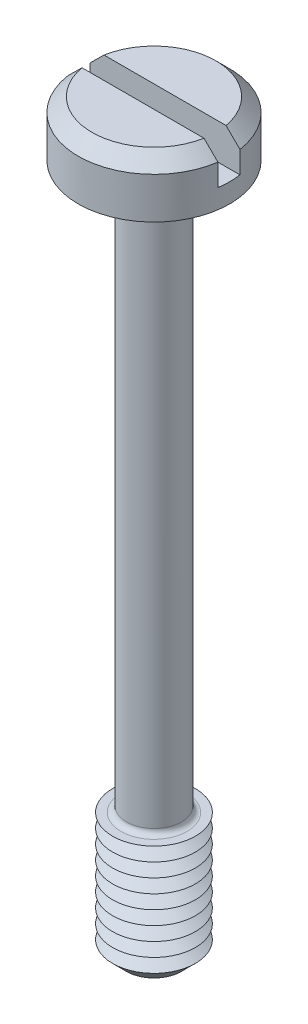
from build123d import *

# Parameters (mm, degrees)
SKETCH1_R           = 2.75
BOSS_EXTRUDE1_DEPTH = 2
SKETCH2_R           = 1
BOSS_EXTRUDE2_DEPTH = 25
SKETCH3_R           = 1.5
BOSS_EXTRUDE3_DEPTH = 4.5
CHAMFER1_SIZE       = 0.5
LPATTERN1_COUNT     = 8
LPATTERN1_PITCH     = 0.5
FILLET1_R           = 0.2
CHAMFER2_SIZE       = 0.5
SKETCH6_W           = 5.5
SKETCH6_H           = 0.8
CUT_EXTRUDE1_DEPTH  = 1.3


with BuildPart() as part:
    # Sketch1 → Boss-Extrude1 (new body)
    with BuildSketch(Plane(origin=(0, 0, 0), x_dir=(1, 0, 0), z_dir=(0, 1, 0))):
        with Locations(Location((0, 0, 0), (0, 0, 270))):
            Circle(SKETCH1_R)
    extrude(amount=BOSS_EXTRUDE1_DEPTH)

    # Sketch2 → Boss-Extrude2 (add)
    with BuildSketch(Plane.XZ):
        with Locations(Location((0, 0, 0), (0, 0, 270))):
            Circle(SKETCH2_R)
    extrude(amount=BOSS_EXTRUDE2_DEPTH)

    # Sketch3 → Boss-Extrude3 (add)
    with BuildSketch(Plane.XZ.offset(25)):
        with Locations(Location((0, 0, 0), (0, 0, 270))):
            Circle(SKETCH3_R)
    extrude(amount=-BOSS_EXTRUDE3_DEPTH)

    # Chamfer1
    chamfer1_edges = [part.edges().sort_by_distance(p)[0] for p in [
        (0, -25, 1.5),
    ]]
    chamfer(chamfer1_edges, length=CHAMFER1_SIZE)

    # Sketch5 → Cut-Revolve1 (revolve, cut)
    with BuildSketch(Plane(origin=(0, 0, 0), x_dir=(0, 0, -1), z_dir=(1, 0, 0))):
        Polygon((-1.5, -20.5), (-1.066987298, -20.75), (-1.5, -21), align=None)
    cut_revolve1 = revolve(axis=Axis((0, -6.58711856, 0), (0, -1, 0)), mode=Mode.SUBTRACT)

    # LPattern1: Cut-Revolve1 ×8
    with Locations(*[(0, -i * LPATTERN1_PITCH, 0) for i in range(1, LPATTERN1_COUNT)]):
        add(cut_revolve1, mode=Mode.SUBTRACT)

    # Fillet1
    fillet1_edges = [part.edges().sort_by_distance(p)[0] for p in [
        (0, 0, 1),
        (0, -20.5, 1),
    ]]
    fillet(fillet1_edges, radius=FILLET1_R)

    # Chamfer2
    chamfer2_edges = [part.edges().sort_by_distance(p)[0] for p in [
        (0, 2, -2.75),
    ]]
    chamfer(chamfer2_edges, length=CHAMFER2_SIZE)

    # Sketch6 → Cut-Extrude1 (cut)
    with BuildSketch(Plane(origin=(0, 2, 0), x_dir=(1, 0, 0), z_dir=(0, 1, 0))):
        Rectangle(SKETCH6_W, SKETCH6_H)
    extrude(amount=-CUT_EXTRUDE1_DEPTH, mode=Mode.SUBTRACT)


solid = part.part
